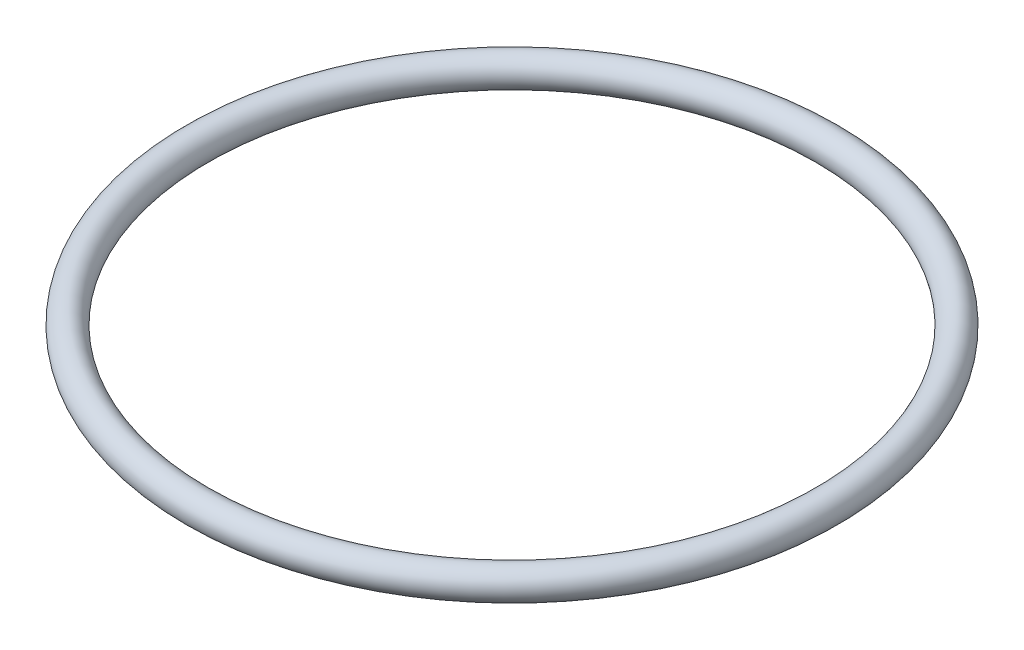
from build123d import *

# Parameters (mm, degrees)
ESQUISSE1_R = 3


with BuildPart() as part:
    # Esquisse1 → R_volution1 (revolve)
    with BuildSketch(Plane.XY, mode=Mode.PRIVATE) as r_volution1_sk:
        with Locations((62, 3)):
            Circle(ESQUISSE1_R)
    revolve(r_volution1_sk.sketch.rotate(Axis((0, 45.569153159, 0), (0, -1, 0)), 90), axis=Axis((0, 45.569153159, 0), (0, -1, 0)))


solid = part.part
